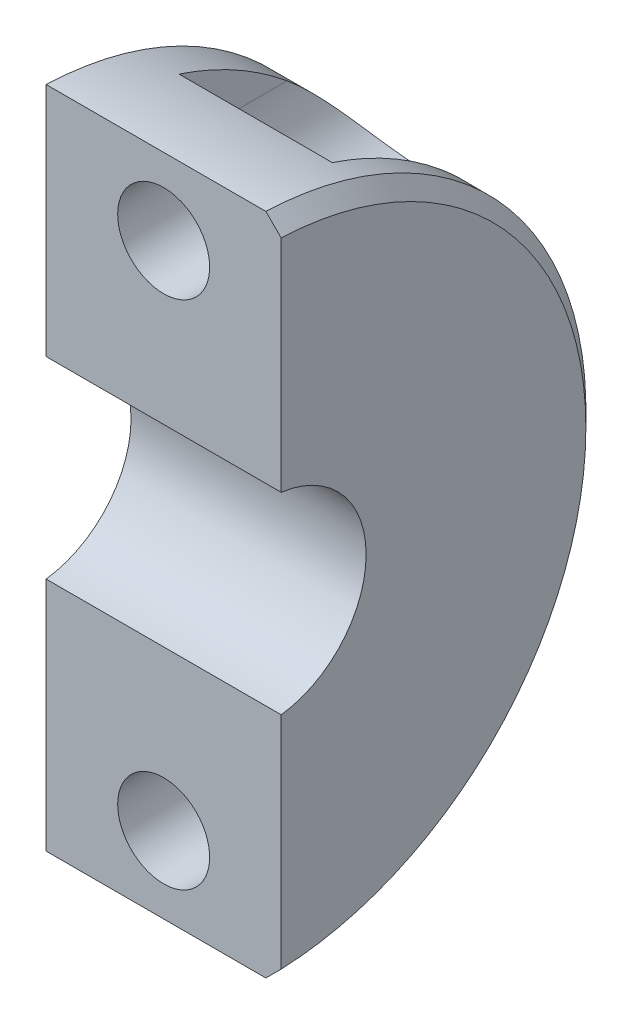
ISO-10303-21;
HEADER;
FILE_DESCRIPTION(('STEP AP214'),'2;1');
FILE_NAME('part.step','',(''),(''),'','','');
FILE_SCHEMA(('AUTOMOTIVE_DESIGN { 1 0 10303 214 1 1 1 1 }'));
ENDSEC;
DATA;
#1=APPLICATION_CONTEXT('core data for automotive mechanical design processes');
#2=APPLICATION_PROTOCOL_DEFINITION('international standard','automotive_design',2000,#1);
#3=PRODUCT_CONTEXT('',#1,'mechanical');
#4=PRODUCT('Part','Part','',(#3));
#5=PRODUCT_RELATED_PRODUCT_CATEGORY('part','',(#4));
#6=PRODUCT_DEFINITION_FORMATION('','',#4);
#7=PRODUCT_DEFINITION_CONTEXT('part definition',#1,'design');
#8=PRODUCT_DEFINITION('design','',#6,#7);
#9=PRODUCT_DEFINITION_SHAPE('','',#8);
#10=(LENGTH_UNIT() NAMED_UNIT(*) SI_UNIT(.MILLI.,.METRE.));
#11=(NAMED_UNIT(*) PLANE_ANGLE_UNIT() SI_UNIT($,.RADIAN.));
#12=(NAMED_UNIT(*) SI_UNIT($,.STERADIAN.) SOLID_ANGLE_UNIT());
#13=UNCERTAINTY_MEASURE_WITH_UNIT(LENGTH_MEASURE(1.E-05),#10,'distance_accuracy_value','');
#14=(GEOMETRIC_REPRESENTATION_CONTEXT(3) GLOBAL_UNCERTAINTY_ASSIGNED_CONTEXT((#13)) GLOBAL_UNIT_ASSIGNED_CONTEXT((#10,
#11,#12)) REPRESENTATION_CONTEXT('',''));
#15=CARTESIAN_POINT('',(0.,0.,0.));
#16=DIRECTION('',(0.,0.,1.));
#17=DIRECTION('',(1.,0.,0.));
#18=AXIS2_PLACEMENT_3D('',#15,#16,#17);
#19=CARTESIAN_POINT('',(52.5,0.,0.));
#20=DIRECTION('',(1.,0.,0.));
#21=DIRECTION('',(0.,0.,-1.));
#22=AXIS2_PLACEMENT_3D('',#19,#20,#21);
#23=PLANE('',#22);
#24=DIRECTION('',(0.,1.,0.));
#25=VECTOR('',#24,1.);
#26=CARTESIAN_POINT('',(52.5,-19.00028996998,-1.190625));
#27=LINE('',#26,#25);
#28=CARTESIAN_POINT('',(52.5000000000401,9.4250948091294,-1.190625));
#29=VERTEX_POINT('',#28);
#30=CARTESIAN_POINT('',(52.4999999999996,30.9771272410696,-1.190625));
#31=VERTEX_POINT('',#30);
#32=EDGE_CURVE('E96',#29,#31,#27,.T.);
#33=ORIENTED_EDGE('',*,*,#32,.F.);
#34=CARTESIAN_POINT('',(52.5000000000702,3.44616505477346E-09,4.89157950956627E-09));
#35=DIRECTION('',(-1.,-8.519415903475E-12,-8.519415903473E-12));
#36=DIRECTION('',(8.519415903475E-12,-1.,0.));
#37=AXIS2_PLACEMENT_3D('',#34,#35,#36);
#38=CIRCLE('',#37,9.5);
#39=CARTESIAN_POINT('',(52.5000000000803,-9.425094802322,-1.190625));
#40=VERTEX_POINT('',#39);
#41=EDGE_CURVE('E19',#29,#40,#38,.T.);
#42=ORIENTED_EDGE('',*,*,#41,.T.);
#43=DIRECTION('',(0.,1.,0.));
#44=VECTOR('',#43,1.);
#45=CARTESIAN_POINT('',(52.5,-19.00028996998,-1.190625));
#46=LINE('',#45,#44);
#47=CARTESIAN_POINT('',(52.5000000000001,-30.9771272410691,-1.190625));
#48=VERTEX_POINT('',#47);
#49=EDGE_CURVE('E132',#48,#40,#46,.T.);
#50=ORIENTED_EDGE('',*,*,#49,.F.);
#51=CARTESIAN_POINT('',(52.5000000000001,0.,0.));
#52=DIRECTION('',(-1.,0.,0.));
#53=DIRECTION('',(0.,0.,1.));
#54=AXIS2_PLACEMENT_3D('',#51,#52,#53);
#55=CIRCLE('',#54,31.0000000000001);
#56=EDGE_CURVE('E100',#31,#48,#55,.T.);
#57=ORIENTED_EDGE('',*,*,#56,.F.);
#58=EDGE_LOOP('',(#33,#42,#50,#57));
#59=FACE_BOUND('',#58,.T.);
#60=ADVANCED_FACE('F16',(#59),#23,.T.);
#61=CARTESIAN_POINT('',(-43.,2.632560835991E-09,4.077975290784E-09));
#62=DIRECTION('',(-1.,-8.519415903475E-12,-8.519415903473E-12));
#63=DIRECTION('',(8.519415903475E-12,-1.,0.));
#64=AXIS2_PLACEMENT_3D('',#61,#62,#63);
#65=CYLINDRICAL_SURFACE('',#64,9.5);
#66=DIRECTION('',(1.,0.,0.));
#67=VECTOR('',#66,1.);
#68=CARTESIAN_POINT('',(76.99992084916,-9.425094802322,-1.190625));
#69=LINE('',#68,#67);
#70=CARTESIAN_POINT('',(29.4999999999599,-9.42509480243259,-1.190625));
#71=VERTEX_POINT('',#70);
#72=EDGE_CURVE('E114',#40,#71,#69,.F.);
#73=ORIENTED_EDGE('',*,*,#72,.F.);
#74=ORIENTED_EDGE('',*,*,#41,.F.);
#75=DIRECTION('',(1.,0.,0.));
#76=VECTOR('',#75,1.);
#77=CARTESIAN_POINT('',(76.99992084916,9.425094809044,-1.190625));
#78=LINE('',#77,#76);
#79=CARTESIAN_POINT('',(29.4999999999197,9.425094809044,-1.190625));
#80=VERTEX_POINT('',#79);
#81=EDGE_CURVE('E111',#80,#29,#78,.T.);
#82=ORIENTED_EDGE('',*,*,#81,.F.);
#83=CARTESIAN_POINT('',(29.4999999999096,3.25021848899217E-09,4.69563294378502E-09));
#84=DIRECTION('',(-1.,-8.519415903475E-12,-8.519415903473E-12));
#85=DIRECTION('',(8.519415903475E-12,-1.,0.));
#86=AXIS2_PLACEMENT_3D('',#83,#84,#85);
#87=CIRCLE('',#86,9.5);
#88=EDGE_CURVE('E214',#80,#71,#87,.T.);
#89=ORIENTED_EDGE('',*,*,#88,.T.);
#90=EDGE_LOOP('',(#73,#74,#82,#89));
#91=FACE_BOUND('',#90,.T.);
#92=ADVANCED_FACE('F110',(#91),#65,.F.);
#93=CARTESIAN_POINT('',(41.,25.,11.53729706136));
#94=DIRECTION('',(0.,0.,-1.));
#95=DIRECTION('',(-1.,0.,0.));
#96=AXIS2_PLACEMENT_3D('',#93,#94,#95);
#97=CYLINDRICAL_SURFACE('',#96,4.5);
#98=CARTESIAN_POINT('',(41.,25.,-10.190625));
#99=DIRECTION('',(0.,0.,-1.));
#100=DIRECTION('',(-1.,0.,0.));
#101=AXIS2_PLACEMENT_3D('',#98,#99,#100);
#102=CIRCLE('',#101,4.5);
#103=CARTESIAN_POINT('',(36.5,25.,-10.190625));
#104=VERTEX_POINT('',#103);
#105=EDGE_CURVE('E206',#104,#104,#102,.T.);
#106=ORIENTED_EDGE('',*,*,#105,.T.);
#107=EDGE_LOOP('',(#106));
#108=FACE_BOUND('',#107,.T.);
#109=CARTESIAN_POINT('',(41.,25.,-1.190625));
#110=DIRECTION('',(0.,0.,-1.));
#111=DIRECTION('',(-1.,0.,0.));
#112=AXIS2_PLACEMENT_3D('',#109,#110,#111);
#113=CIRCLE('',#112,4.5);
#114=CARTESIAN_POINT('',(36.5,25.,-1.190625));
#115=VERTEX_POINT('',#114);
#116=EDGE_CURVE('E120',#115,#115,#113,.T.);
#117=ORIENTED_EDGE('',*,*,#116,.F.);
#118=EDGE_LOOP('',(#117));
#119=FACE_BOUND('',#118,.T.);
#120=ADVANCED_FACE('F270',(#108,#119),#97,.F.);
#121=CARTESIAN_POINT('',(41.,-25.,11.53729706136));
#122=DIRECTION('',(0.,0.,-1.));
#123=DIRECTION('',(-1.,0.,0.));
#124=AXIS2_PLACEMENT_3D('',#121,#122,#123);
#125=CYLINDRICAL_SURFACE('',#124,4.5);
#126=CARTESIAN_POINT('',(41.,-25.,-10.190625));
#127=DIRECTION('',(0.,0.,-1.));
#128=DIRECTION('',(-1.,0.,0.));
#129=AXIS2_PLACEMENT_3D('',#126,#127,#128);
#130=CIRCLE('',#129,4.5);
#131=CARTESIAN_POINT('',(36.5,-25.,-10.190625));
#132=VERTEX_POINT('',#131);
#133=EDGE_CURVE('E192',#132,#132,#130,.T.);
#134=ORIENTED_EDGE('',*,*,#133,.T.);
#135=EDGE_LOOP('',(#134));
#136=FACE_BOUND('',#135,.T.);
#137=CARTESIAN_POINT('',(41.,-25.,-1.190625));
#138=DIRECTION('',(0.,0.,-1.));
#139=DIRECTION('',(-1.,0.,0.));
#140=AXIS2_PLACEMENT_3D('',#137,#138,#139);
#141=CIRCLE('',#140,4.5);
#142=CARTESIAN_POINT('',(36.5,-25.,-1.190625));
#143=VERTEX_POINT('',#142);
#144=EDGE_CURVE('E131',#143,#143,#141,.T.);
#145=ORIENTED_EDGE('',*,*,#144,.F.);
#146=EDGE_LOOP('',(#145));
#147=FACE_BOUND('',#146,.T.);
#148=ADVANCED_FACE('F249',(#136,#147),#125,.F.);
#149=CARTESIAN_POINT('',(50.9999999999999,0.,0.));
#150=DIRECTION('',(-1.,0.,0.));
#151=DIRECTION('',(0.,0.,1.));
#152=AXIS2_PLACEMENT_3D('',#149,#150,#151);
#153=CONICAL_SURFACE('',#152,32.4999999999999,0.785398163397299);
#154=CARTESIAN_POINT('',(50.9999999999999,-32.4781836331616,-1.190625));
#155=CARTESIAN_POINT('',(51.250004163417,-32.2280117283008,-1.190625));
#156=CARTESIAN_POINT('',(51.5000062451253,-31.9778377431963,-1.190625));
#157=CARTESIAN_POINT('',(52.0000062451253,-31.4774856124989,-1.190625));
#158=CARTESIAN_POINT('',(52.2500041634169,-31.2273074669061,-1.190625));
#159=CARTESIAN_POINT('',(52.4999999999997,-30.9771272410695,-1.190625));
#160=B_SPLINE_CURVE_WITH_KNOTS('',3,(#154,#155,#156,#157,#158,#159),.UNSPECIFIED.,.F.,.F.,(4,2,
4),(0.,1.0610337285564,2.12206745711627),.UNSPECIFIED.);
#161=CARTESIAN_POINT('',(51.,-32.4781836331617,-1.19062500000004));
#162=VERTEX_POINT('',#161);
#163=EDGE_CURVE('E133',#162,#48,#160,.T.);
#164=ORIENTED_EDGE('',*,*,#163,.F.);
#165=CARTESIAN_POINT('',(51.,0.,0.));
#166=DIRECTION('',(-1.,0.,0.));
#167=DIRECTION('',(0.,0.,1.));
#168=AXIS2_PLACEMENT_3D('',#165,#166,#167);
#169=CIRCLE('',#168,32.5);
#170=CARTESIAN_POINT('',(51.,32.4781836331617,-1.19062500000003));
#171=VERTEX_POINT('',#170);
#172=EDGE_CURVE('E189',#171,#162,#169,.T.);
#173=ORIENTED_EDGE('',*,*,#172,.F.);
#174=CARTESIAN_POINT('',(52.4999999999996,30.9771272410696,-1.190625));
#175=CARTESIAN_POINT('',(52.2500041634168,31.2273074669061,-1.190625));
#176=CARTESIAN_POINT('',(52.0000062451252,31.477485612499,-1.190625));
#177=CARTESIAN_POINT('',(51.5000062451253,31.9778377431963,-1.190625));
#178=CARTESIAN_POINT('',(51.250004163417,32.2280117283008,-1.190625));
#179=CARTESIAN_POINT('',(50.9999999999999,32.4781836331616,-1.190625));
#180=B_SPLINE_CURVE_WITH_KNOTS('',3,(#174,#175,#176,#177,#178,#179),.UNSPECIFIED.,.F.,.F.,(4,2,
4),(0.,1.0610337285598,2.12206745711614),.UNSPECIFIED.);
#181=EDGE_CURVE('E105',#31,#171,#180,.T.);
#182=ORIENTED_EDGE('',*,*,#181,.F.);
#183=ORIENTED_EDGE('',*,*,#56,.T.);
#184=EDGE_LOOP('',(#164,#173,#182,#183));
#185=FACE_BOUND('',#184,.T.);
#186=ADVANCED_FACE('F243',(#185),#153,.T.);
#187=CARTESIAN_POINT('',(76.99992084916,-19.00028996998,-1.190625));
#188=DIRECTION('',(0.,0.,1.));
#189=DIRECTION('',(1.,0.,0.));
#190=AXIS2_PLACEMENT_3D('',#187,#188,#189);
#191=PLANE('',#190);
#192=ORIENTED_EDGE('',*,*,#144,.T.);
#193=EDGE_LOOP('',(#192));
#194=FACE_BOUND('',#193,.T.);
#195=ORIENTED_EDGE('',*,*,#49,.T.);
#196=ORIENTED_EDGE('',*,*,#72,.T.);
#197=DIRECTION('',(0.,1.,0.));
#198=VECTOR('',#197,1.);
#199=CARTESIAN_POINT('',(29.5,-41.54761493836,-1.190625));
#200=LINE('',#199,#198);
#201=CARTESIAN_POINT('',(29.5,-32.4781836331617,-1.19062500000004));
#202=VERTEX_POINT('',#201);
#203=EDGE_CURVE('E106',#71,#202,#200,.F.);
#204=ORIENTED_EDGE('',*,*,#203,.T.);
#205=DIRECTION('',(-1.,0.,0.));
#206=VECTOR('',#205,1.);
#207=CARTESIAN_POINT('',(52.5,-32.4781836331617,-1.19062500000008));
#208=LINE('',#207,#206);
#209=EDGE_CURVE('E191',#162,#202,#208,.T.);
#210=ORIENTED_EDGE('',*,*,#209,.F.);
#211=ORIENTED_EDGE('',*,*,#163,.T.);
#212=EDGE_LOOP('',(#195,#196,#204,#210,#211));
#213=FACE_BOUND('',#212,.T.);
#214=ADVANCED_FACE('F248',(#194,#213),#191,.T.);
#215=CARTESIAN_POINT('',(29.5,-41.54761493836,0.));
#216=DIRECTION('',(1.,0.,0.));
#217=DIRECTION('',(0.,0.,-1.));
#218=AXIS2_PLACEMENT_3D('',#215,#216,#217);
#219=PLANE('',#218);
#220=DIRECTION('',(0.,1.,0.));
#221=VECTOR('',#220,1.);
#222=CARTESIAN_POINT('',(29.5,-19.00028996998,-1.190625));
#223=LINE('',#222,#221);
#224=CARTESIAN_POINT('',(29.5,32.4781836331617,-1.19062500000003));
#225=VERTEX_POINT('',#224);
#226=EDGE_CURVE('E119',#225,#80,#223,.F.);
#227=ORIENTED_EDGE('',*,*,#226,.F.);
#228=CARTESIAN_POINT('',(29.5,0.,0.));
#229=DIRECTION('',(-1.,0.,0.));
#230=DIRECTION('',(0.,0.,1.));
#231=AXIS2_PLACEMENT_3D('',#228,#229,#230);
#232=CIRCLE('',#231,32.5);
#233=EDGE_CURVE('E217',#202,#225,#232,.F.);
#234=ORIENTED_EDGE('',*,*,#233,.F.);
#235=ORIENTED_EDGE('',*,*,#203,.F.);
#236=ORIENTED_EDGE('',*,*,#88,.F.);
#237=EDGE_LOOP('',(#227,#234,#235,#236));
#238=FACE_BOUND('',#237,.T.);
#239=ADVANCED_FACE('F264',(#238),#219,.F.);
#240=CARTESIAN_POINT('',(76.99992084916,-19.00028996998,-1.190625));
#241=DIRECTION('',(0.,0.,1.));
#242=DIRECTION('',(1.,0.,0.));
#243=AXIS2_PLACEMENT_3D('',#240,#241,#242);
#244=PLANE('',#243);
#245=ORIENTED_EDGE('',*,*,#116,.T.);
#246=EDGE_LOOP('',(#245));
#247=FACE_BOUND('',#246,.T.);
#248=ORIENTED_EDGE('',*,*,#226,.T.);
#249=ORIENTED_EDGE('',*,*,#81,.T.);
#250=ORIENTED_EDGE('',*,*,#32,.T.);
#251=ORIENTED_EDGE('',*,*,#181,.T.);
#252=DIRECTION('',(-1.,0.,0.));
#253=VECTOR('',#252,1.);
#254=CARTESIAN_POINT('',(52.5,32.4781836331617,-1.19062500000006));
#255=LINE('',#254,#253);
#256=EDGE_CURVE('E215',#225,#171,#255,.F.);
#257=ORIENTED_EDGE('',*,*,#256,.F.);
#258=EDGE_LOOP('',(#248,#249,#250,#251,#257));
#259=FACE_BOUND('',#258,.T.);
#260=ADVANCED_FACE('F116',(#247,#259),#244,.T.);
#261=CARTESIAN_POINT('',(48.5,31.52133436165,-32.5));
#262=DIRECTION('',(1.,0.,0.));
#263=DIRECTION('',(0.,0.,-1.));
#264=AXIS2_PLACEMENT_3D('',#261,#262,#263);
#265=PLANE('',#264);
#266=DIRECTION('',(0.,0.,1.));
#267=VECTOR('',#266,1.);
#268=CARTESIAN_POINT('',(48.5,25.,-32.5));
#269=LINE('',#268,#267);
#270=CARTESIAN_POINT('',(48.5,25.,-20.7665596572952));
#271=VERTEX_POINT('',#270);
#272=CARTESIAN_POINT('',(48.5,25.,-10.190625));
#273=VERTEX_POINT('',#272);
#274=EDGE_CURVE('E202',#271,#273,#269,.T.);
#275=ORIENTED_EDGE('',*,*,#274,.T.);
#276=DIRECTION('',(0.,1.,0.));
#277=VECTOR('',#276,1.);
#278=CARTESIAN_POINT('',(48.5,25.,-10.190625));
#279=LINE('',#278,#277);
#280=CARTESIAN_POINT('',(48.5,30.8609974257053,-10.1906249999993));
#281=VERTEX_POINT('',#280);
#282=EDGE_CURVE('E123',#273,#281,#279,.T.);
#283=ORIENTED_EDGE('',*,*,#282,.T.);
#284=CARTESIAN_POINT('',(48.5,0.,0.));
#285=DIRECTION('',(-1.,0.,0.));
#286=DIRECTION('',(0.,0.,1.));
#287=AXIS2_PLACEMENT_3D('',#284,#285,#286);
#288=CIRCLE('',#287,32.5);
#289=EDGE_CURVE('E211',#271,#281,#288,.F.);
#290=ORIENTED_EDGE('',*,*,#289,.F.);
#291=EDGE_LOOP('',(#275,#283,#290));
#292=FACE_BOUND('',#291,.T.);
#293=ADVANCED_FACE('F285',(#292),#265,.F.);
#294=CARTESIAN_POINT('',(41.,25.,-10.190625));
#295=DIRECTION('',(0.,0.,1.));
#296=DIRECTION('',(1.,0.,0.));
#297=AXIS2_PLACEMENT_3D('',#294,#295,#296);
#298=PLANE('',#297);
#299=ORIENTED_EDGE('',*,*,#105,.F.);
#300=EDGE_LOOP('',(#299));
#301=FACE_BOUND('',#300,.T.);
#302=ORIENTED_EDGE('',*,*,#282,.F.);
#303=CARTESIAN_POINT('',(41.,25.,-10.190625));
#304=DIRECTION('',(0.,0.,1.));
#305=DIRECTION('',(1.,0.,0.));
#306=AXIS2_PLACEMENT_3D('',#303,#304,#305);
#307=CIRCLE('',#306,7.5);
#308=CARTESIAN_POINT('',(33.5,25.,-10.190625));
#309=VERTEX_POINT('',#308);
#310=EDGE_CURVE('E201',#273,#309,#307,.F.);
#311=ORIENTED_EDGE('',*,*,#310,.T.);
#312=DIRECTION('',(0.,1.,0.));
#313=VECTOR('',#312,1.);
#314=CARTESIAN_POINT('',(33.5,25.,-10.190625));
#315=LINE('',#314,#313);
#316=CARTESIAN_POINT('',(33.5,30.8609974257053,-10.1906249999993));
#317=VERTEX_POINT('',#316);
#318=EDGE_CURVE('E204',#309,#317,#315,.T.);
#319=ORIENTED_EDGE('',*,*,#318,.T.);
#320=DIRECTION('',(-1.,0.,0.));
#321=VECTOR('',#320,1.);
#322=CARTESIAN_POINT('',(52.5,30.8609974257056,-10.1906249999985));
#323=LINE('',#322,#321);
#324=EDGE_CURVE('E207',#281,#317,#323,.T.);
#325=ORIENTED_EDGE('',*,*,#324,.F.);
#326=EDGE_LOOP('',(#302,#311,#319,#325));
#327=FACE_BOUND('',#326,.T.);
#328=ADVANCED_FACE('F290',(#301,#327),#298,.F.);
#329=CARTESIAN_POINT('',(33.5,25.,-32.5));
#330=DIRECTION('',(-1.,0.,0.));
#331=DIRECTION('',(0.,0.,1.));
#332=AXIS2_PLACEMENT_3D('',#329,#330,#331);
#333=PLANE('',#332);
#334=ORIENTED_EDGE('',*,*,#318,.F.);
#335=DIRECTION('',(0.,0.,1.));
#336=VECTOR('',#335,1.);
#337=CARTESIAN_POINT('',(33.5,25.,-32.5));
#338=LINE('',#337,#336);
#339=CARTESIAN_POINT('',(33.5,24.9999999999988,-20.7665596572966));
#340=VERTEX_POINT('',#339);
#341=EDGE_CURVE('E199',#309,#340,#338,.F.);
#342=ORIENTED_EDGE('',*,*,#341,.T.);
#343=CARTESIAN_POINT('',(33.5,0.,0.));
#344=DIRECTION('',(-1.,0.,0.));
#345=DIRECTION('',(0.,0.,1.));
#346=AXIS2_PLACEMENT_3D('',#343,#344,#345);
#347=CIRCLE('',#346,32.5);
#348=EDGE_CURVE('E210',#317,#340,#347,.T.);
#349=ORIENTED_EDGE('',*,*,#348,.F.);
#350=EDGE_LOOP('',(#334,#342,#349));
#351=FACE_BOUND('',#350,.T.);
#352=ADVANCED_FACE('F354',(#351),#333,.F.);
#353=CARTESIAN_POINT('',(41.,25.,-32.5));
#354=DIRECTION('',(0.,0.,1.));
#355=DIRECTION('',(1.,0.,0.));
#356=AXIS2_PLACEMENT_3D('',#353,#354,#355);
#357=CYLINDRICAL_SURFACE('',#356,7.5);
#358=ORIENTED_EDGE('',*,*,#341,.F.);
#359=ORIENTED_EDGE('',*,*,#310,.F.);
#360=ORIENTED_EDGE('',*,*,#274,.F.);
#361=CARTESIAN_POINT('',(33.5,24.9999999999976,-20.766559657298));
#362=CARTESIAN_POINT('',(33.500023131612,24.7990980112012,-21.0084585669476));
#363=CARTESIAN_POINT('',(33.5080769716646,24.5945714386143,-21.2474974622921));
#364=CARTESIAN_POINT('',(33.5421396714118,24.1790607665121,-21.719150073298));
#365=CARTESIAN_POINT('',(33.5681734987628,23.9680680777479,-21.9517543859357));
#366=CARTESIAN_POINT('',(33.6404446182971,23.5389366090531,-22.4113442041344));
#367=CARTESIAN_POINT('',(33.6868730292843,23.3207487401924,-22.6382545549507));
#368=CARTESIAN_POINT('',(33.8020096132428,22.8808998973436,-23.0827216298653));
#369=CARTESIAN_POINT('',(33.8707058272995,22.6592408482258,-23.3002833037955));
#370=CARTESIAN_POINT('',(34.0176571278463,22.2551353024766,-23.6859055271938));
#371=CARTESIAN_POINT('',(34.091874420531,22.0729215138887,-23.8557492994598));
#372=CARTESIAN_POINT('',(34.2576330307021,21.7090359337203,-24.1873584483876));
#373=CARTESIAN_POINT('',(34.349170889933,21.5273640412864,-24.349125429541));
#374=CARTESIAN_POINT('',(34.5501990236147,21.1669195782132,-24.663099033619));
#375=CARTESIAN_POINT('',(34.6596277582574,20.9881393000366,-24.815336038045));
#376=CARTESIAN_POINT('',(34.8974067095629,20.6349514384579,-25.1097910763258));
#377=CARTESIAN_POINT('',(35.0257533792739,20.4605430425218,-25.2520109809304));
#378=CARTESIAN_POINT('',(35.2788515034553,20.1469563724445,-25.5026174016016));
#379=CARTESIAN_POINT('',(35.4006492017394,20.0067439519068,-25.6126964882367));
#380=CARTESIAN_POINT('',(35.6577613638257,19.7325728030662,-25.8245147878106));
#381=CARTESIAN_POINT('',(35.7930730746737,19.5986128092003,-25.9262556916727));
#382=CARTESIAN_POINT('',(36.0771496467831,19.3384937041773,-26.1208550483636));
#383=CARTESIAN_POINT('',(36.2259224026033,19.2123392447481,-26.2137082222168));
#384=CARTESIAN_POINT('',(36.5364234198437,18.9696344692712,-26.3898741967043));
#385=CARTESIAN_POINT('',(36.698151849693,18.8530842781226,-26.4731868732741));
#386=CARTESIAN_POINT('',(37.0349580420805,18.6305852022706,-26.6302454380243));
#387=CARTESIAN_POINT('',(37.2101177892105,18.5247123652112,-26.7039236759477));
#388=CARTESIAN_POINT('',(37.5717754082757,18.3261837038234,-26.840557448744));
#389=CARTESIAN_POINT('',(37.7582735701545,18.2335282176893,-26.9035127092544));
#390=CARTESIAN_POINT('',(38.1411300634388,18.0630881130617,-27.0182421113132));
#391=CARTESIAN_POINT('',(38.3374832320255,17.9852958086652,-27.0700220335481));
#392=CARTESIAN_POINT('',(38.7384647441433,17.8459458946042,-27.1620913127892));
#393=CARTESIAN_POINT('',(38.9430919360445,17.7843860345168,-27.202382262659));
#394=CARTESIAN_POINT('',(39.3333632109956,17.6850980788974,-27.2670197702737));
#395=CARTESIAN_POINT('',(39.5182817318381,17.645379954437,-27.2927110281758));
#396=CARTESIAN_POINT('',(39.8916087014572,17.5799345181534,-27.3349122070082));
#397=CARTESIAN_POINT('',(40.0800169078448,17.5542062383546,-27.351422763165));
#398=CARTESIAN_POINT('',(40.4587514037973,17.5171366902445,-27.3751786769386));
#399=CARTESIAN_POINT('',(40.6490769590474,17.5057901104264,-27.3824274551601));
#400=CARTESIAN_POINT('',(41.0301658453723,17.4976397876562,-27.3876364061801));
#401=CARTESIAN_POINT('',(41.2209291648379,17.5008356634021,-27.3855968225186));
#402=CARTESIAN_POINT('',(41.5895105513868,17.5210694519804,-27.3726551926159));
#403=CARTESIAN_POINT('',(41.7673970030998,17.5372356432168,-27.362311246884));
#404=CARTESIAN_POINT('',(42.120916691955,17.5820966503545,-27.3335066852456));
#405=CARTESIAN_POINT('',(42.2965499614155,17.6107912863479,-27.3150461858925));
#406=CARTESIAN_POINT('',(42.6443159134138,17.6803233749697,-27.2700912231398));
#407=CARTESIAN_POINT('',(42.8164491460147,17.7211589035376,-27.2435980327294));
#408=CARTESIAN_POINT('',(43.156104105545,17.8144427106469,-27.182691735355));
#409=CARTESIAN_POINT('',(43.3236257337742,17.8668912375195,-27.148278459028));
#410=CARTESIAN_POINT('',(43.6542768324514,17.983179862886,-27.0713895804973));
#411=CARTESIAN_POINT('',(43.8173624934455,18.0471046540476,-27.0288538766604));
#412=CARTESIAN_POINT('',(44.1368842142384,18.1852903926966,-26.9360750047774));
#413=CARTESIAN_POINT('',(44.2933180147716,18.2595548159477,-26.8858292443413));
#414=CARTESIAN_POINT('',(44.5986404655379,18.4174985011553,-26.7778806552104));
#415=CARTESIAN_POINT('',(44.7475301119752,18.5011765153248,-26.7201788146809));
#416=CARTESIAN_POINT('',(45.0371653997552,18.6770250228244,-26.5975605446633));
#417=CARTESIAN_POINT('',(45.1779080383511,18.7691986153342,-26.5326414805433));
#418=CARTESIAN_POINT('',(45.4601752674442,18.967700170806,-26.3911389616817));
#419=CARTESIAN_POINT('',(45.6010714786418,19.0745668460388,-26.3140580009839));
#420=CARTESIAN_POINT('',(45.8724791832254,19.295650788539,-26.1523731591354));
#421=CARTESIAN_POINT('',(46.0029864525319,19.4098710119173,-26.0677662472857));
#422=CARTESIAN_POINT('',(46.2532336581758,19.6443558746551,-25.8915193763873));
#423=CARTESIAN_POINT('',(46.3729784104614,19.7646177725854,-25.7998825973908));
#424=CARTESIAN_POINT('',(46.601680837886,20.0100776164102,-25.6099764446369));
#425=CARTESIAN_POINT('',(46.710636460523,20.135276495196,-25.5117058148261));
#426=CARTESIAN_POINT('',(46.9590840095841,20.4401872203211,-25.2685649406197));
#427=CARTESIAN_POINT('',(47.0934415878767,20.6217400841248,-25.1207307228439));
#428=CARTESIAN_POINT('',(47.3416272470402,20.9896329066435,-24.814163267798));
#429=CARTESIAN_POINT('',(47.4554482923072,21.1759744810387,-24.6554263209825));
#430=CARTESIAN_POINT('',(47.6638143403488,21.5518216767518,-24.3275853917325));
#431=CARTESIAN_POINT('',(47.7582794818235,21.7413370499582,-24.1584420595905));
#432=CARTESIAN_POINT('',(47.9284653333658,22.1208281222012,-23.8114491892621));
#433=CARTESIAN_POINT('',(48.0041820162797,22.3108039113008,-23.6335977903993));
#434=CARTESIAN_POINT('',(48.1478630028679,22.7172262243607,-23.2436670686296));
#435=CARTESIAN_POINT('',(48.2130792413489,22.9334857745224,-23.0303828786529));
#436=CARTESIAN_POINT('',(48.3224196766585,23.3625607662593,-22.5950056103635));
#437=CARTESIAN_POINT('',(48.3665343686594,23.575374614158,-22.3729086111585));
#438=CARTESIAN_POINT('',(48.4351860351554,23.9937659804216,-21.9235571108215));
#439=CARTESIAN_POINT('',(48.4599244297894,24.1993961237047,-21.696381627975));
#440=CARTESIAN_POINT('',(48.4923102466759,24.6044941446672,-21.2358940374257));
#441=CARTESIAN_POINT('',(48.4999788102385,24.8039693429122,-21.0025898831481));
#442=CARTESIAN_POINT('',(48.5,24.9999999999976,-20.766559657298));
#443=B_SPLINE_CURVE_WITH_KNOTS('',3,(#361,#362,#363,#364,#365,#366,#367,#368,#369,#370,#371,
#372,#373,#374,#375,#376,#377,#378,#379,#380,#381,#382,#383,#384,#385,#386,#387,#388,#389,#390,
#391,#392,#393,#394,#395,#396,#397,#398,#399,#400,#401,#402,#403,#404,#405,#406,#407,#408,#409,
#410,#411,#412,#413,#414,#415,#416,#417,#418,#419,#420,#421,#422,#423,#424,#425,#426,#427,#428,
#429,#430,#431,#432,#433,#434,#435,#436,#437,#438,#439,#440,#441,#442),.UNSPECIFIED.,.F.,.F.,(4,
2,2,2,2,2,2,2,2,2,2,2,2,2,2,2,2,2,2,2,2,2,2,2,2,2,2,2,2,2,2,2,2,2,2,2,2,2,2,2,4),(0.,
0.943378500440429,1.88806965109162,2.84180897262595,3.79503693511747,4.57415533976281,
5.35311834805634,6.12945622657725,6.90564873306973,7.55271824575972,8.19965621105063,
8.84697607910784,9.49430436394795,10.1459584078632,10.7976291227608,11.4489619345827,
12.1002043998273,12.6720831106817,13.2439222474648,13.8155501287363,14.3871630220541,
14.923286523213,15.4594023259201,15.9954332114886,16.5314755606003,17.0716498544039,
17.6120061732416,18.1522909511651,18.6927736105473,19.2709032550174,19.849266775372,
20.4273701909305,21.0055833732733,21.8142213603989,22.6231358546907,23.435323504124,
24.2476854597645,25.1787132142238,26.1101599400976,27.0317906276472,27.9522792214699),.UNSPECIFIED.);
#444=EDGE_CURVE('E147',#340,#271,#443,.T.);
#445=ORIENTED_EDGE('',*,*,#444,.F.);
#446=EDGE_LOOP('',(#358,#359,#360,#445));
#447=FACE_BOUND('',#446,.T.);
#448=ADVANCED_FACE('F177',(#447),#357,.F.);
#449=CARTESIAN_POINT('',(41.,-25.,-32.5));
#450=DIRECTION('',(0.,0.,1.));
#451=DIRECTION('',(1.,0.,0.));
#452=AXIS2_PLACEMENT_3D('',#449,#450,#451);
#453=CYLINDRICAL_SURFACE('',#452,7.5);
#454=DIRECTION('',(0.,0.,1.));
#455=VECTOR('',#454,1.);
#456=CARTESIAN_POINT('',(33.5,-25.,-32.5));
#457=LINE('',#456,#455);
#458=CARTESIAN_POINT('',(33.5,-25.,-10.190625));
#459=VERTEX_POINT('',#458);
#460=CARTESIAN_POINT('',(33.5,-25.,-20.7665596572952));
#461=VERTEX_POINT('',#460);
#462=EDGE_CURVE('E180',#459,#461,#457,.F.);
#463=ORIENTED_EDGE('',*,*,#462,.T.);
#464=CARTESIAN_POINT('',(48.5,-24.9999999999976,-20.766559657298));
#465=CARTESIAN_POINT('',(48.499976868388,-24.7990980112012,-21.0084585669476));
#466=CARTESIAN_POINT('',(48.4919230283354,-24.5945714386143,-21.2474974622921));
#467=CARTESIAN_POINT('',(48.4578603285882,-24.1790607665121,-21.719150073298));
#468=CARTESIAN_POINT('',(48.4318265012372,-23.9680680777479,-21.9517543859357));
#469=CARTESIAN_POINT('',(48.359555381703,-23.5389366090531,-22.4113442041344));
#470=CARTESIAN_POINT('',(48.3131269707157,-23.3207487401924,-22.6382545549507));
#471=CARTESIAN_POINT('',(48.1979903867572,-22.8808998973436,-23.0827216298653));
#472=CARTESIAN_POINT('',(48.1292941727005,-22.6592408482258,-23.3002833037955));
#473=CARTESIAN_POINT('',(47.9823428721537,-22.2551353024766,-23.6859055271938));
#474=CARTESIAN_POINT('',(47.908125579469,-22.0729215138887,-23.8557492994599));
#475=CARTESIAN_POINT('',(47.7423669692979,-21.7090359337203,-24.1873584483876));
#476=CARTESIAN_POINT('',(47.650829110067,-21.5273640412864,-24.349125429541));
#477=CARTESIAN_POINT('',(47.4498009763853,-21.1669195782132,-24.663099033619));
#478=CARTESIAN_POINT('',(47.3403722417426,-20.9881393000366,-24.815336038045));
#479=CARTESIAN_POINT('',(47.1025932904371,-20.6349514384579,-25.1097910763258));
#480=CARTESIAN_POINT('',(46.9742466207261,-20.4605430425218,-25.2520109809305));
#481=CARTESIAN_POINT('',(46.7211484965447,-20.1469563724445,-25.5026174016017));
#482=CARTESIAN_POINT('',(46.5993507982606,-20.0067439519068,-25.6126964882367));
#483=CARTESIAN_POINT('',(46.3422386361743,-19.7325728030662,-25.8245147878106));
#484=CARTESIAN_POINT('',(46.2069269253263,-19.5986128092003,-25.9262556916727));
#485=CARTESIAN_POINT('',(45.9228503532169,-19.3384937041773,-26.1208550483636));
#486=CARTESIAN_POINT('',(45.7740775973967,-19.2123392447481,-26.2137082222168));
#487=CARTESIAN_POINT('',(45.4635765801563,-18.9696344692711,-26.3898741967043));
#488=CARTESIAN_POINT('',(45.3018481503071,-18.8530842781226,-26.4731868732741));
#489=CARTESIAN_POINT('',(44.9650419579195,-18.6305852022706,-26.6302454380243));
#490=CARTESIAN_POINT('',(44.7898822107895,-18.5247123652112,-26.7039236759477));
#491=CARTESIAN_POINT('',(44.4282245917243,-18.3261837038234,-26.840557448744));
#492=CARTESIAN_POINT('',(44.2417264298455,-18.2335282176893,-26.9035127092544));
#493=CARTESIAN_POINT('',(43.8588699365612,-18.0630881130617,-27.0182421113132));
#494=CARTESIAN_POINT('',(43.6625167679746,-17.9852958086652,-27.0700220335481));
#495=CARTESIAN_POINT('',(43.2615352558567,-17.8459458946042,-27.1620913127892));
#496=CARTESIAN_POINT('',(43.0569080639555,-17.7843860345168,-27.202382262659));
#497=CARTESIAN_POINT('',(42.6666367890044,-17.6850980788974,-27.2670197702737));
#498=CARTESIAN_POINT('',(42.4817182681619,-17.645379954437,-27.2927110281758));
#499=CARTESIAN_POINT('',(42.1083912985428,-17.5799345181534,-27.3349122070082));
#500=CARTESIAN_POINT('',(41.9199830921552,-17.5542062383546,-27.351422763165));
#501=CARTESIAN_POINT('',(41.5412485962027,-17.5171366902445,-27.3751786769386));
#502=CARTESIAN_POINT('',(41.3509230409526,-17.5057901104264,-27.3824274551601));
#503=CARTESIAN_POINT('',(40.9698341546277,-17.4976397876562,-27.3876364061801));
#504=CARTESIAN_POINT('',(40.7790708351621,-17.5008356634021,-27.3855968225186));
#505=CARTESIAN_POINT('',(40.4104894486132,-17.5210694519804,-27.3726551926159));
#506=CARTESIAN_POINT('',(40.2326029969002,-17.5372356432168,-27.362311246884));
#507=CARTESIAN_POINT('',(39.879083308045,-17.5820966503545,-27.3335066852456));
#508=CARTESIAN_POINT('',(39.7034500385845,-17.6107912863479,-27.3150461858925));
#509=CARTESIAN_POINT('',(39.3556840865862,-17.6803233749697,-27.2700912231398));
#510=CARTESIAN_POINT('',(39.1835508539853,-17.7211589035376,-27.2435980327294));
#511=CARTESIAN_POINT('',(38.843895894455,-17.8144427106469,-27.182691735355));
#512=CARTESIAN_POINT('',(38.6763742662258,-17.8668912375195,-27.148278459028));
#513=CARTESIAN_POINT('',(38.3457231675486,-17.983179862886,-27.0713895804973));
#514=CARTESIAN_POINT('',(38.1826375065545,-18.0471046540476,-27.0288538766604));
#515=CARTESIAN_POINT('',(37.8631157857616,-18.1852903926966,-26.9360750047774));
#516=CARTESIAN_POINT('',(37.7066819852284,-18.2595548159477,-26.8858292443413));
#517=CARTESIAN_POINT('',(37.4013595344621,-18.4174985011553,-26.7778806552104));
#518=CARTESIAN_POINT('',(37.2524698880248,-18.5011765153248,-26.7201788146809));
#519=CARTESIAN_POINT('',(36.9628346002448,-18.6770250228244,-26.5975605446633));
#520=CARTESIAN_POINT('',(36.8220919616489,-18.7691986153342,-26.5326414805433));
#521=CARTESIAN_POINT('',(36.5398247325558,-18.967700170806,-26.3911389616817));
#522=CARTESIAN_POINT('',(36.3989285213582,-19.0745668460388,-26.3140580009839));
#523=CARTESIAN_POINT('',(36.1275208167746,-19.295650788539,-26.1523731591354));
#524=CARTESIAN_POINT('',(35.9970135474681,-19.4098710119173,-26.0677662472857));
#525=CARTESIAN_POINT('',(35.7467663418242,-19.6443558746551,-25.8915193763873));
#526=CARTESIAN_POINT('',(35.6270215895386,-19.7646177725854,-25.7998825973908));
#527=CARTESIAN_POINT('',(35.398319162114,-20.0100776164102,-25.6099764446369));
#528=CARTESIAN_POINT('',(35.289363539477,-20.1352764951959,-25.5117058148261));
#529=CARTESIAN_POINT('',(35.0409159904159,-20.4401872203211,-25.2685649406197));
#530=CARTESIAN_POINT('',(34.9065584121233,-20.6217400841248,-25.1207307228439));
#531=CARTESIAN_POINT('',(34.6583727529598,-20.9896329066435,-24.814163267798));
#532=CARTESIAN_POINT('',(34.5445517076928,-21.1759744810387,-24.6554263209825));
#533=CARTESIAN_POINT('',(34.3361856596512,-21.5518216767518,-24.3275853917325));
#534=CARTESIAN_POINT('',(34.2417205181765,-21.7413370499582,-24.1584420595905));
#535=CARTESIAN_POINT('',(34.0715346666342,-22.1208281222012,-23.8114491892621));
#536=CARTESIAN_POINT('',(33.9958179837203,-22.3108039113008,-23.6335977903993));
#537=CARTESIAN_POINT('',(33.8521369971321,-22.7172262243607,-23.2436670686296));
#538=CARTESIAN_POINT('',(33.7869207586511,-22.9334857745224,-23.0303828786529));
#539=CARTESIAN_POINT('',(33.6775803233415,-23.3625607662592,-22.5950056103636));
#540=CARTESIAN_POINT('',(33.6334656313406,-23.575374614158,-22.3729086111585));
#541=CARTESIAN_POINT('',(33.5648139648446,-23.9937659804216,-21.9235571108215));
#542=CARTESIAN_POINT('',(33.5400755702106,-24.1993961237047,-21.696381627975));
#543=CARTESIAN_POINT('',(33.5076897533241,-24.6044941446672,-21.2358940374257));
#544=CARTESIAN_POINT('',(33.5000211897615,-24.8039693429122,-21.0025898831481));
#545=CARTESIAN_POINT('',(33.5,-24.9999999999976,-20.766559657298));
#546=B_SPLINE_CURVE_WITH_KNOTS('',3,(#464,#465,#466,#467,#468,#469,#470,#471,#472,#473,#474,
#475,#476,#477,#478,#479,#480,#481,#482,#483,#484,#485,#486,#487,#488,#489,#490,#491,#492,#493,
#494,#495,#496,#497,#498,#499,#500,#501,#502,#503,#504,#505,#506,#507,#508,#509,#510,#511,#512,
#513,#514,#515,#516,#517,#518,#519,#520,#521,#522,#523,#524,#525,#526,#527,#528,#529,#530,#531,
#532,#533,#534,#535,#536,#537,#538,#539,#540,#541,#542,#543,#544,#545),.UNSPECIFIED.,.F.,.F.,(4,
2,2,2,2,2,2,2,2,2,2,2,2,2,2,2,2,2,2,2,2,2,2,2,2,2,2,2,2,2,2,2,2,2,2,2,2,2,2,2,4),(0.,
0.943378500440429,1.88806965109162,2.84180897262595,3.79503693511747,4.57415533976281,
5.35311834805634,6.12945622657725,6.90564873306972,7.55271824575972,8.19965621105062,
8.84697607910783,9.49430436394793,10.1459584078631,10.7976291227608,11.4489619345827,
12.1002043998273,12.6720831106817,13.2439222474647,13.8155501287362,14.3871630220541,
14.923286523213,15.4594023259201,15.9954332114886,16.5314755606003,17.0716498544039,
17.6120061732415,18.1522909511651,18.6927736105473,19.2709032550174,19.849266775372,
20.4273701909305,21.0055833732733,21.8142213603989,22.6231358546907,23.435323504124,
24.2476854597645,25.1787132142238,26.1101599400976,27.0317906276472,27.9522792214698),.UNSPECIFIED.);
#547=CARTESIAN_POINT('',(48.5,-24.9999999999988,-20.7665596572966));
#548=VERTEX_POINT('',#547);
#549=EDGE_CURVE('E138',#548,#461,#546,.T.);
#550=ORIENTED_EDGE('',*,*,#549,.F.);
#551=DIRECTION('',(0.,0.,-1.));
#552=VECTOR('',#551,1.);
#553=CARTESIAN_POINT('',(48.5,-25.,-32.5));
#554=LINE('',#553,#552);
#555=CARTESIAN_POINT('',(48.5,-25.,-10.190625));
#556=VERTEX_POINT('',#555);
#557=EDGE_CURVE('E188',#548,#556,#554,.F.);
#558=ORIENTED_EDGE('',*,*,#557,.T.);
#559=CARTESIAN_POINT('',(41.,-25.,-10.190625));
#560=DIRECTION('',(0.,0.,1.));
#561=DIRECTION('',(1.,0.,0.));
#562=AXIS2_PLACEMENT_3D('',#559,#560,#561);
#563=CIRCLE('',#562,7.5);
#564=EDGE_CURVE('E197',#556,#459,#563,.T.);
#565=ORIENTED_EDGE('',*,*,#564,.T.);
#566=EDGE_LOOP('',(#463,#550,#558,#565));
#567=FACE_BOUND('',#566,.T.);
#568=ADVANCED_FACE('F154',(#567),#453,.F.);
#569=CARTESIAN_POINT('',(33.5,-25.,-32.5));
#570=DIRECTION('',(-1.,0.,0.));
#571=DIRECTION('',(0.,0.,1.));
#572=AXIS2_PLACEMENT_3D('',#569,#570,#571);
#573=PLANE('',#572);
#574=CARTESIAN_POINT('',(33.5,0.,0.));
#575=DIRECTION('',(-1.,0.,0.));
#576=DIRECTION('',(0.,0.,1.));
#577=AXIS2_PLACEMENT_3D('',#574,#575,#576);
#578=CIRCLE('',#577,32.5);
#579=CARTESIAN_POINT('',(33.5,-30.8609974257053,-10.1906249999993));
#580=VERTEX_POINT('',#579);
#581=EDGE_CURVE('E135',#461,#580,#578,.T.);
#582=ORIENTED_EDGE('',*,*,#581,.F.);
#583=ORIENTED_EDGE('',*,*,#462,.F.);
#584=DIRECTION('',(0.,1.,0.));
#585=VECTOR('',#584,1.);
#586=CARTESIAN_POINT('',(33.5,-25.,-10.190625));
#587=LINE('',#586,#585);
#588=EDGE_CURVE('E183',#459,#580,#587,.F.);
#589=ORIENTED_EDGE('',*,*,#588,.T.);
#590=EDGE_LOOP('',(#582,#583,#589));
#591=FACE_BOUND('',#590,.T.);
#592=ADVANCED_FACE('F169',(#591),#573,.F.);
#593=CARTESIAN_POINT('',(41.,-25.,-10.190625));
#594=DIRECTION('',(0.,0.,1.));
#595=DIRECTION('',(1.,0.,0.));
#596=AXIS2_PLACEMENT_3D('',#593,#594,#595);
#597=PLANE('',#596);
#598=ORIENTED_EDGE('',*,*,#133,.F.);
#599=EDGE_LOOP('',(#598));
#600=FACE_BOUND('',#599,.T.);
#601=DIRECTION('',(0.,1.,0.));
#602=VECTOR('',#601,1.);
#603=CARTESIAN_POINT('',(48.5,-31.52133436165,-10.190625));
#604=LINE('',#603,#602);
#605=CARTESIAN_POINT('',(48.5,-30.8609974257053,-10.1906249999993));
#606=VERTEX_POINT('',#605);
#607=EDGE_CURVE('E34',#556,#606,#604,.F.);
#608=ORIENTED_EDGE('',*,*,#607,.T.);
#609=DIRECTION('',(-1.,0.,0.));
#610=VECTOR('',#609,1.);
#611=CARTESIAN_POINT('',(52.5,-30.8609974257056,-10.1906249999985));
#612=LINE('',#611,#610);
#613=EDGE_CURVE('E25',#580,#606,#612,.F.);
#614=ORIENTED_EDGE('',*,*,#613,.F.);
#615=ORIENTED_EDGE('',*,*,#588,.F.);
#616=ORIENTED_EDGE('',*,*,#564,.F.);
#617=EDGE_LOOP('',(#608,#614,#615,#616));
#618=FACE_BOUND('',#617,.T.);
#619=ADVANCED_FACE('F166',(#600,#618),#597,.F.);
#620=CARTESIAN_POINT('',(48.5,-31.52133436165,-32.5));
#621=DIRECTION('',(1.,0.,0.));
#622=DIRECTION('',(0.,0.,-1.));
#623=AXIS2_PLACEMENT_3D('',#620,#621,#622);
#624=PLANE('',#623);
#625=CARTESIAN_POINT('',(48.5,0.,0.));
#626=DIRECTION('',(-1.,0.,0.));
#627=DIRECTION('',(0.,0.,1.));
#628=AXIS2_PLACEMENT_3D('',#625,#626,#627);
#629=CIRCLE('',#628,32.5);
#630=EDGE_CURVE('E11',#606,#548,#629,.F.);
#631=ORIENTED_EDGE('',*,*,#630,.F.);
#632=ORIENTED_EDGE('',*,*,#607,.F.);
#633=ORIENTED_EDGE('',*,*,#557,.F.);
#634=EDGE_LOOP('',(#631,#632,#633));
#635=FACE_BOUND('',#634,.T.);
#636=ADVANCED_FACE('F161',(#635),#624,.F.);
#637=CARTESIAN_POINT('',(52.5,0.,0.));
#638=DIRECTION('',(-1.,0.,0.));
#639=DIRECTION('',(0.,0.,1.));
#640=AXIS2_PLACEMENT_3D('',#637,#638,#639);
#641=CYLINDRICAL_SURFACE('',#640,32.5);
#642=ORIENTED_EDGE('',*,*,#613,.T.);
#643=ORIENTED_EDGE('',*,*,#630,.T.);
#644=ORIENTED_EDGE('',*,*,#549,.T.);
#645=ORIENTED_EDGE('',*,*,#581,.T.);
#646=EDGE_LOOP('',(#642,#643,#644,#645));
#647=FACE_BOUND('',#646,.T.);
#648=ORIENTED_EDGE('',*,*,#348,.T.);
#649=ORIENTED_EDGE('',*,*,#444,.T.);
#650=ORIENTED_EDGE('',*,*,#289,.T.);
#651=ORIENTED_EDGE('',*,*,#324,.T.);
#652=EDGE_LOOP('',(#648,#649,#650,#651));
#653=FACE_BOUND('',#652,.T.);
#654=ORIENTED_EDGE('',*,*,#233,.T.);
#655=ORIENTED_EDGE('',*,*,#256,.T.);
#656=ORIENTED_EDGE('',*,*,#172,.T.);
#657=ORIENTED_EDGE('',*,*,#209,.T.);
#658=EDGE_LOOP('',(#654,#655,#656,#657));
#659=FACE_BOUND('',#658,.T.);
#660=ADVANCED_FACE('F157',(#647,#653,#659),#641,.T.);
#661=CLOSED_SHELL('',(#60,#92,#120,#148,#186,#214,#239,#260,#293,#328,#352,#448,#568,#592,#619,
#636,#660));
#662=MANIFOLD_SOLID_BREP('B1',#661);
#663=ADVANCED_BREP_SHAPE_REPRESENTATION('',(#18,#662),#14);
#664=SHAPE_DEFINITION_REPRESENTATION(#9,#663);
ENDSEC;
END-ISO-10303-21;
